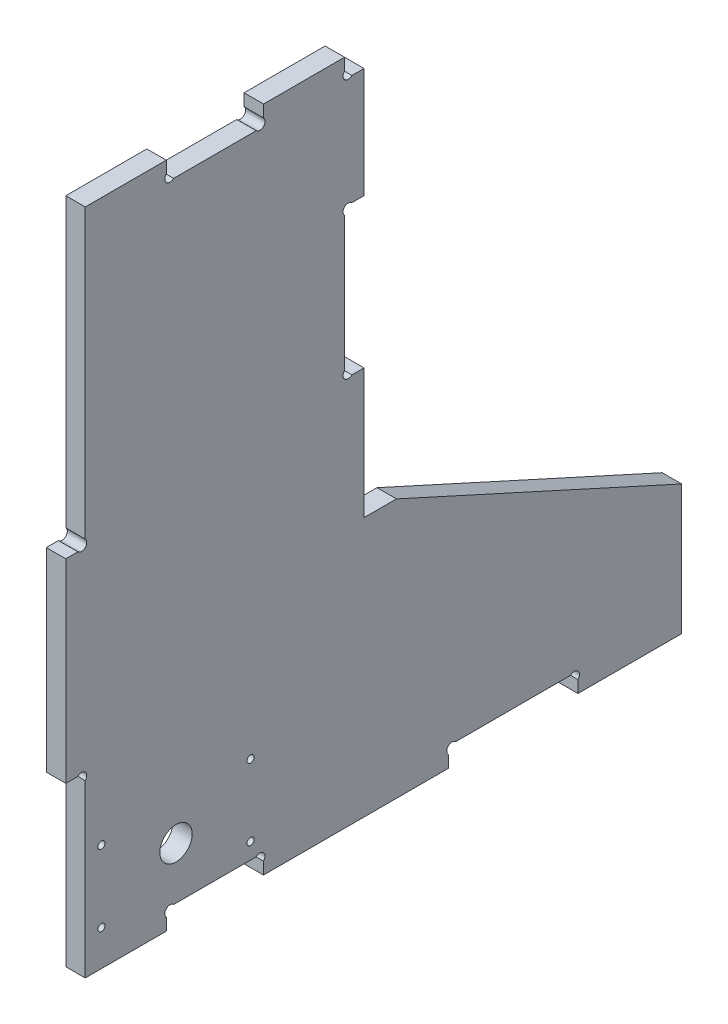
ISO-10303-21;
HEADER;
FILE_DESCRIPTION(('STEP AP214'),'2;1');
FILE_NAME('part.step','',(''),(''),'','','');
FILE_SCHEMA(('AUTOMOTIVE_DESIGN { 1 0 10303 214 1 1 1 1 }'));
ENDSEC;
DATA;
#1=APPLICATION_CONTEXT('core data for automotive mechanical design processes');
#2=APPLICATION_PROTOCOL_DEFINITION('international standard','automotive_design',2000,#1);
#3=PRODUCT_CONTEXT('',#1,'mechanical');
#4=PRODUCT('Part','Part','',(#3));
#5=PRODUCT_RELATED_PRODUCT_CATEGORY('part','',(#4));
#6=PRODUCT_DEFINITION_FORMATION('','',#4);
#7=PRODUCT_DEFINITION_CONTEXT('part definition',#1,'design');
#8=PRODUCT_DEFINITION('design','',#6,#7);
#9=PRODUCT_DEFINITION_SHAPE('','',#8);
#10=(LENGTH_UNIT() NAMED_UNIT(*) SI_UNIT(.MILLI.,.METRE.));
#11=(NAMED_UNIT(*) PLANE_ANGLE_UNIT() SI_UNIT($,.RADIAN.));
#12=(NAMED_UNIT(*) SI_UNIT($,.STERADIAN.) SOLID_ANGLE_UNIT());
#13=UNCERTAINTY_MEASURE_WITH_UNIT(LENGTH_MEASURE(1.E-05),#10,'distance_accuracy_value','');
#14=(GEOMETRIC_REPRESENTATION_CONTEXT(3) GLOBAL_UNCERTAINTY_ASSIGNED_CONTEXT((#13)) GLOBAL_UNIT_ASSIGNED_CONTEXT((#10,
#11,#12)) REPRESENTATION_CONTEXT('',''));
#15=CARTESIAN_POINT('',(0.,0.,0.));
#16=DIRECTION('',(0.,0.,1.));
#17=DIRECTION('',(1.,0.,0.));
#18=AXIS2_PLACEMENT_3D('',#15,#16,#17);
#19=CARTESIAN_POINT('',(6.,4.86862915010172,-156.868629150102));
#20=DIRECTION('',(1.,0.,0.));
#21=DIRECTION('',(0.,0.,-1.));
#22=AXIS2_PLACEMENT_3D('',#19,#20,#21);
#23=PLANE('',#22);
#24=CARTESIAN_POINT('',(6.,33.,-11.));
#25=DIRECTION('',(1.,0.,0.));
#26=DIRECTION('',(0.,0.,1.));
#27=AXIS2_PLACEMENT_3D('',#24,#25,#26);
#28=CIRCLE('',#27,1.1);
#29=CARTESIAN_POINT('',(6.,33.,-9.89999999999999));
#30=VERTEX_POINT('',#29);
#31=EDGE_CURVE('E659',#30,#30,#28,.T.);
#32=ORIENTED_EDGE('',*,*,#31,.F.);
#33=EDGE_LOOP('',(#32));
#34=FACE_BOUND('',#33,.T.);
#35=CARTESIAN_POINT('',(6.,11.,-57.));
#36=DIRECTION('',(1.,0.,0.));
#37=DIRECTION('',(0.,0.,1.));
#38=AXIS2_PLACEMENT_3D('',#35,#36,#37);
#39=CIRCLE('',#38,1.09999999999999);
#40=CARTESIAN_POINT('',(6.,11.,-55.9));
#41=VERTEX_POINT('',#40);
#42=EDGE_CURVE('E671',#41,#41,#39,.T.);
#43=ORIENTED_EDGE('',*,*,#42,.F.);
#44=EDGE_LOOP('',(#43));
#45=FACE_BOUND('',#44,.T.);
#46=DIRECTION('',(0.,1.,0.));
#47=VECTOR('',#46,1.);
#48=CARTESIAN_POINT('',(6.,120.,-92.));
#49=LINE('',#48,#47);
#50=CARTESIAN_POINT('',(6.,80.,-92.));
#51=VERTEX_POINT('',#50);
#52=CARTESIAN_POINT('',(6.,120.,-92.));
#53=VERTEX_POINT('',#52);
#54=EDGE_CURVE('E401',#51,#53,#49,.T.);
#55=ORIENTED_EDGE('',*,*,#54,.T.);
#56=DIRECTION('',(0.,0.,1.));
#57=VECTOR('',#56,1.);
#58=CARTESIAN_POINT('',(6.,120.,-88.2627416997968));
#59=LINE('',#58,#57);
#60=CARTESIAN_POINT('',(6.,120.,-88.2627416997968));
#61=VERTEX_POINT('',#60);
#62=EDGE_CURVE('E189',#53,#61,#59,.T.);
#63=ORIENTED_EDGE('',*,*,#62,.T.);
#64=CARTESIAN_POINT('',(6.,121.131370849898,-87.1313708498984));
#65=DIRECTION('',(-1.,0.,0.));
#66=DIRECTION('',(0.,0.,1.));
#67=AXIS2_PLACEMENT_3D('',#64,#65,#66);
#68=CIRCLE('',#67,1.59999999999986);
#69=CARTESIAN_POINT('',(6.,122.262741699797,-86.));
#70=VERTEX_POINT('',#69);
#71=EDGE_CURVE('E512',#61,#70,#68,.T.);
#72=ORIENTED_EDGE('',*,*,#71,.T.);
#73=DIRECTION('',(0.,1.,0.));
#74=VECTOR('',#73,1.);
#75=CARTESIAN_POINT('',(6.,163.737258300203,-86.));
#76=LINE('',#75,#74);
#77=CARTESIAN_POINT('',(6.,163.737258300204,-86.0000000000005));
#78=VERTEX_POINT('',#77);
#79=EDGE_CURVE('E531',#70,#78,#76,.T.);
#80=ORIENTED_EDGE('',*,*,#79,.T.);
#81=CARTESIAN_POINT('',(6.,164.868629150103,-87.1313708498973));
#82=DIRECTION('',(-1.,0.,0.));
#83=DIRECTION('',(0.,0.,-1.));
#84=AXIS2_PLACEMENT_3D('',#81,#82,#83);
#85=CIRCLE('',#84,1.59999999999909);
#86=CARTESIAN_POINT('',(6.,166.,-88.2627416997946));
#87=VERTEX_POINT('',#86);
#88=EDGE_CURVE('E528',#78,#87,#85,.T.);
#89=ORIENTED_EDGE('',*,*,#88,.T.);
#90=DIRECTION('',(0.,0.,-1.));
#91=VECTOR('',#90,1.);
#92=CARTESIAN_POINT('',(6.,166.,-88.2627416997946));
#93=LINE('',#92,#91);
#94=CARTESIAN_POINT('',(6.,166.,-92.));
#95=VERTEX_POINT('',#94);
#96=EDGE_CURVE('E530',#87,#95,#93,.T.);
#97=ORIENTED_EDGE('',*,*,#96,.T.);
#98=DIRECTION('',(0.,1.,0.));
#99=VECTOR('',#98,1.);
#100=CARTESIAN_POINT('',(6.,200.,-92.));
#101=LINE('',#100,#99);
#102=CARTESIAN_POINT('',(6.,200.,-92.));
#103=VERTEX_POINT('',#102);
#104=EDGE_CURVE('E533',#95,#103,#101,.T.);
#105=ORIENTED_EDGE('',*,*,#104,.T.);
#106=DIRECTION('',(0.,0.,1.));
#107=VECTOR('',#106,1.);
#108=CARTESIAN_POINT('',(6.,200.,-88.262741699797));
#109=LINE('',#108,#107);
#110=CARTESIAN_POINT('',(6.,200.,-88.262741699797));
#111=VERTEX_POINT('',#110);
#112=EDGE_CURVE('E539',#103,#111,#109,.T.);
#113=ORIENTED_EDGE('',*,*,#112,.T.);
#114=CARTESIAN_POINT('',(6.,201.131370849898,-87.1313708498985));
#115=DIRECTION('',(-1.,0.,0.));
#116=DIRECTION('',(0.,0.,-1.));
#117=AXIS2_PLACEMENT_3D('',#114,#115,#116);
#118=CIRCLE('',#117,1.60000000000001);
#119=CARTESIAN_POINT('',(6.,202.262741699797,-86.));
#120=VERTEX_POINT('',#119);
#121=EDGE_CURVE('E541',#111,#120,#118,.T.);
#122=ORIENTED_EDGE('',*,*,#121,.T.);
#123=DIRECTION('',(0.,1.,0.));
#124=VECTOR('',#123,1.);
#125=CARTESIAN_POINT('',(6.,206.,-86.));
#126=LINE('',#125,#124);
#127=CARTESIAN_POINT('',(6.,206.,-86.));
#128=VERTEX_POINT('',#127);
#129=EDGE_CURVE('E543',#120,#128,#126,.T.);
#130=ORIENTED_EDGE('',*,*,#129,.T.);
#131=DIRECTION('',(0.,0.,1.));
#132=VECTOR('',#131,1.);
#133=CARTESIAN_POINT('',(6.,206.,-61.));
#134=LINE('',#133,#132);
#135=CARTESIAN_POINT('',(6.,206.,-61.));
#136=VERTEX_POINT('',#135);
#137=EDGE_CURVE('E545',#128,#136,#134,.T.);
#138=ORIENTED_EDGE('',*,*,#137,.T.);
#139=DIRECTION('',(0.,-1.,0.));
#140=VECTOR('',#139,1.);
#141=CARTESIAN_POINT('',(6.,202.262741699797,-61.));
#142=LINE('',#141,#140);
#143=CARTESIAN_POINT('',(6.,202.262741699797,-61.));
#144=VERTEX_POINT('',#143);
#145=EDGE_CURVE('E547',#136,#144,#142,.T.);
#146=ORIENTED_EDGE('',*,*,#145,.T.);
#147=CARTESIAN_POINT('',(6.,201.131370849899,-59.8686291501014));
#148=DIRECTION('',(-1.,0.,0.));
#149=DIRECTION('',(0.,0.,-1.));
#150=AXIS2_PLACEMENT_3D('',#147,#148,#149);
#151=CIRCLE('',#150,1.60000000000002);
#152=CARTESIAN_POINT('',(6.,200.,-58.737258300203));
#153=VERTEX_POINT('',#152);
#154=EDGE_CURVE('E549',#144,#153,#151,.T.);
#155=ORIENTED_EDGE('',*,*,#154,.T.);
#156=DIRECTION('',(0.,0.,1.));
#157=VECTOR('',#156,1.);
#158=CARTESIAN_POINT('',(6.,200.,-33.262741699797));
#159=LINE('',#158,#157);
#160=CARTESIAN_POINT('',(6.,200.,-33.262741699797));
#161=VERTEX_POINT('',#160);
#162=EDGE_CURVE('E551',#153,#161,#159,.T.);
#163=ORIENTED_EDGE('',*,*,#162,.T.);
#164=CARTESIAN_POINT('',(6.,201.131370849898,-32.1313708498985));
#165=DIRECTION('',(-1.,0.,0.));
#166=DIRECTION('',(0.,0.,1.));
#167=AXIS2_PLACEMENT_3D('',#164,#165,#166);
#168=CIRCLE('',#167,1.60000000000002);
#169=CARTESIAN_POINT('',(6.,202.262741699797,-31.));
#170=VERTEX_POINT('',#169);
#171=EDGE_CURVE('E553',#161,#170,#168,.T.);
#172=ORIENTED_EDGE('',*,*,#171,.T.);
#173=DIRECTION('',(0.,1.,0.));
#174=VECTOR('',#173,1.);
#175=CARTESIAN_POINT('',(6.,202.262741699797,-31.));
#176=LINE('',#175,#174);
#177=CARTESIAN_POINT('',(6.,206.,-31.));
#178=VERTEX_POINT('',#177);
#179=EDGE_CURVE('E555',#170,#178,#176,.T.);
#180=ORIENTED_EDGE('',*,*,#179,.T.);
#181=DIRECTION('',(0.,0.,1.));
#182=VECTOR('',#181,1.);
#183=CARTESIAN_POINT('',(6.,206.,-6.));
#184=LINE('',#183,#182);
#185=CARTESIAN_POINT('',(6.,206.,-6.));
#186=VERTEX_POINT('',#185);
#187=EDGE_CURVE('E557',#178,#186,#184,.T.);
#188=ORIENTED_EDGE('',*,*,#187,.T.);
#189=DIRECTION('',(0.,-1.,0.));
#190=VECTOR('',#189,1.);
#191=CARTESIAN_POINT('',(6.,117.262741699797,-6.));
#192=LINE('',#191,#190);
#193=CARTESIAN_POINT('',(6.,117.262741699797,-6.00000000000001));
#194=VERTEX_POINT('',#193);
#195=EDGE_CURVE('E559',#186,#194,#192,.T.);
#196=ORIENTED_EDGE('',*,*,#195,.T.);
#197=CARTESIAN_POINT('',(6.,116.131370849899,-4.86862915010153));
#198=DIRECTION('',(-1.,0.,0.));
#199=DIRECTION('',(0.,0.,1.));
#200=AXIS2_PLACEMENT_3D('',#197,#198,#199);
#201=CIRCLE('',#200,1.60000000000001);
#202=CARTESIAN_POINT('',(6.,115.,-3.73725830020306));
#203=VERTEX_POINT('',#202);
#204=EDGE_CURVE('E561',#194,#203,#201,.T.);
#205=ORIENTED_EDGE('',*,*,#204,.T.);
#206=DIRECTION('',(0.,0.,1.));
#207=VECTOR('',#206,1.);
#208=CARTESIAN_POINT('',(6.,115.,-3.73725830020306));
#209=LINE('',#208,#207);
#210=CARTESIAN_POINT('',(6.,115.,0.));
#211=VERTEX_POINT('',#210);
#212=EDGE_CURVE('E563',#203,#211,#209,.T.);
#213=ORIENTED_EDGE('',*,*,#212,.T.);
#214=DIRECTION('',(0.,-1.,0.));
#215=VECTOR('',#214,1.);
#216=CARTESIAN_POINT('',(6.,115.,0.));
#217=LINE('',#216,#215);
#218=CARTESIAN_POINT('',(6.,55.,0.));
#219=VERTEX_POINT('',#218);
#220=EDGE_CURVE('E565',#211,#219,#217,.T.);
#221=ORIENTED_EDGE('',*,*,#220,.T.);
#222=DIRECTION('',(0.,0.,-1.));
#223=VECTOR('',#222,1.);
#224=CARTESIAN_POINT('',(6.,55.,0.));
#225=LINE('',#224,#223);
#226=CARTESIAN_POINT('',(6.,55.,-3.73725830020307));
#227=VERTEX_POINT('',#226);
#228=EDGE_CURVE('E567',#219,#227,#225,.T.);
#229=ORIENTED_EDGE('',*,*,#228,.T.);
#230=CARTESIAN_POINT('',(6.,53.8686291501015,-4.86862915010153));
#231=DIRECTION('',(-1.,0.,0.));
#232=DIRECTION('',(0.,0.,-1.));
#233=AXIS2_PLACEMENT_3D('',#230,#231,#232);
#234=CIRCLE('',#233,1.59999999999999);
#235=CARTESIAN_POINT('',(6.,52.7372583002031,-6.));
#236=VERTEX_POINT('',#235);
#237=EDGE_CURVE('E569',#227,#236,#234,.T.);
#238=ORIENTED_EDGE('',*,*,#237,.T.);
#239=DIRECTION('',(0.,-1.,0.));
#240=VECTOR('',#239,1.);
#241=CARTESIAN_POINT('',(6.,52.7372583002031,-6.));
#242=LINE('',#241,#240);
#243=CARTESIAN_POINT('',(6.,0.,-6.));
#244=VERTEX_POINT('',#243);
#245=EDGE_CURVE('E571',#236,#244,#242,.T.);
#246=ORIENTED_EDGE('',*,*,#245,.T.);
#247=DIRECTION('',(0.,0.,-1.));
#248=VECTOR('',#247,1.);
#249=CARTESIAN_POINT('',(6.,0.,-6.));
#250=LINE('',#249,#248);
#251=CARTESIAN_POINT('',(6.,0.,-31.));
#252=VERTEX_POINT('',#251);
#253=EDGE_CURVE('E573',#244,#252,#250,.T.);
#254=ORIENTED_EDGE('',*,*,#253,.T.);
#255=DIRECTION('',(0.,1.,0.));
#256=VECTOR('',#255,1.);
#257=CARTESIAN_POINT('',(6.,3.73725830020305,-31.));
#258=LINE('',#257,#256);
#259=CARTESIAN_POINT('',(6.,3.73725830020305,-31.));
#260=VERTEX_POINT('',#259);
#261=EDGE_CURVE('E575',#252,#260,#258,.T.);
#262=ORIENTED_EDGE('',*,*,#261,.T.);
#263=CARTESIAN_POINT('',(6.,4.86862915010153,-32.1313708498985));
#264=DIRECTION('',(-1.,0.,0.));
#265=DIRECTION('',(0.,0.,-1.));
#266=AXIS2_PLACEMENT_3D('',#263,#264,#265);
#267=CIRCLE('',#266,1.60000000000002);
#268=CARTESIAN_POINT('',(6.,6.00000000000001,-33.262741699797));
#269=VERTEX_POINT('',#268);
#270=EDGE_CURVE('E577',#260,#269,#267,.T.);
#271=ORIENTED_EDGE('',*,*,#270,.T.);
#272=DIRECTION('',(0.,0.,-1.));
#273=VECTOR('',#272,1.);
#274=CARTESIAN_POINT('',(6.,6.00000000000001,-33.262741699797));
#275=LINE('',#274,#273);
#276=CARTESIAN_POINT('',(6.,6.00000000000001,-58.737258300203));
#277=VERTEX_POINT('',#276);
#278=EDGE_CURVE('E579',#269,#277,#275,.T.);
#279=ORIENTED_EDGE('',*,*,#278,.T.);
#280=CARTESIAN_POINT('',(6.,4.86862915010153,-59.8686291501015));
#281=DIRECTION('',(-1.,0.,0.));
#282=DIRECTION('',(0.,0.,1.));
#283=AXIS2_PLACEMENT_3D('',#280,#281,#282);
#284=CIRCLE('',#283,1.60000000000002);
#285=CARTESIAN_POINT('',(6.,3.73725830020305,-61.));
#286=VERTEX_POINT('',#285);
#287=EDGE_CURVE('E581',#277,#286,#284,.T.);
#288=ORIENTED_EDGE('',*,*,#287,.T.);
#289=DIRECTION('',(0.,-1.,0.));
#290=VECTOR('',#289,1.);
#291=CARTESIAN_POINT('',(6.,3.73725830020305,-61.));
#292=LINE('',#291,#290);
#293=CARTESIAN_POINT('',(6.,0.,-61.));
#294=VERTEX_POINT('',#293);
#295=EDGE_CURVE('E583',#286,#294,#292,.T.);
#296=ORIENTED_EDGE('',*,*,#295,.T.);
#297=DIRECTION('',(0.,0.,-1.));
#298=VECTOR('',#297,1.);
#299=CARTESIAN_POINT('',(6.,0.,-61.));
#300=LINE('',#299,#298);
#301=CARTESIAN_POINT('',(6.,0.,-118.));
#302=VERTEX_POINT('',#301);
#303=EDGE_CURVE('E585',#294,#302,#300,.T.);
#304=ORIENTED_EDGE('',*,*,#303,.T.);
#305=DIRECTION('',(0.,1.,0.));
#306=VECTOR('',#305,1.);
#307=CARTESIAN_POINT('',(6.,3.7372583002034,-118.));
#308=LINE('',#307,#306);
#309=CARTESIAN_POINT('',(6.,3.7372583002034,-118.));
#310=VERTEX_POINT('',#309);
#311=EDGE_CURVE('E587',#302,#310,#308,.T.);
#312=ORIENTED_EDGE('',*,*,#311,.T.);
#313=CARTESIAN_POINT('',(6.,4.86862915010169,-119.131370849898));
#314=DIRECTION('',(-1.,0.,0.));
#315=DIRECTION('',(0.,0.,1.));
#316=AXIS2_PLACEMENT_3D('',#313,#314,#315);
#317=CIRCLE('',#316,1.59999999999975);
#318=CARTESIAN_POINT('',(6.,5.99999999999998,-120.262741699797));
#319=VERTEX_POINT('',#318);
#320=EDGE_CURVE('E589',#310,#319,#317,.T.);
#321=ORIENTED_EDGE('',*,*,#320,.T.);
#322=DIRECTION('',(0.,0.,-1.));
#323=VECTOR('',#322,1.);
#324=CARTESIAN_POINT('',(6.,5.99999999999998,-120.262741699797));
#325=LINE('',#324,#323);
#326=CARTESIAN_POINT('',(6.,5.99999999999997,-155.737258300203));
#327=VERTEX_POINT('',#326);
#328=EDGE_CURVE('E591',#319,#327,#325,.T.);
#329=ORIENTED_EDGE('',*,*,#328,.T.);
#330=CARTESIAN_POINT('',(6.,4.86862915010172,-156.868629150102));
#331=DIRECTION('',(-1.,0.,0.));
#332=DIRECTION('',(0.,0.,-1.));
#333=AXIS2_PLACEMENT_3D('',#330,#331,#332);
#334=CIRCLE('',#333,1.59999999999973);
#335=CARTESIAN_POINT('',(6.,3.73725830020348,-158.));
#336=VERTEX_POINT('',#335);
#337=EDGE_CURVE('E593',#327,#336,#334,.T.);
#338=ORIENTED_EDGE('',*,*,#337,.T.);
#339=DIRECTION('',(0.,-1.,0.));
#340=VECTOR('',#339,1.);
#341=CARTESIAN_POINT('',(6.,3.73725830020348,-158.));
#342=LINE('',#341,#340);
#343=CARTESIAN_POINT('',(6.,0.,-158.));
#344=VERTEX_POINT('',#343);
#345=EDGE_CURVE('E595',#336,#344,#342,.T.);
#346=ORIENTED_EDGE('',*,*,#345,.T.);
#347=DIRECTION('',(0.,0.,-1.));
#348=VECTOR('',#347,1.);
#349=CARTESIAN_POINT('',(6.,0.,-190.));
#350=LINE('',#349,#348);
#351=CARTESIAN_POINT('',(6.,0.,-190.));
#352=VERTEX_POINT('',#351);
#353=EDGE_CURVE('E304',#344,#352,#350,.T.);
#354=ORIENTED_EDGE('',*,*,#353,.T.);
#355=DIRECTION('',(0.,1.,0.));
#356=VECTOR('',#355,1.);
#357=CARTESIAN_POINT('',(6.,40.,-190.));
#358=LINE('',#357,#356);
#359=CARTESIAN_POINT('',(6.,40.,-190.));
#360=VERTEX_POINT('',#359);
#361=EDGE_CURVE('E298',#352,#360,#358,.T.);
#362=ORIENTED_EDGE('',*,*,#361,.T.);
#363=DIRECTION('',(0.,0.413802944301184,0.910366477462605));
#364=VECTOR('',#363,1.);
#365=CARTESIAN_POINT('',(6.,40.,-190.));
#366=LINE('',#365,#364);
#367=CARTESIAN_POINT('',(6.,80.,-102.));
#368=VERTEX_POINT('',#367);
#369=EDGE_CURVE('E302',#360,#368,#366,.T.);
#370=ORIENTED_EDGE('',*,*,#369,.T.);
#371=DIRECTION('',(0.,0.,1.));
#372=VECTOR('',#371,1.);
#373=CARTESIAN_POINT('',(6.,80.,-92.));
#374=LINE('',#373,#372);
#375=EDGE_CURVE('E50',#368,#51,#374,.T.);
#376=ORIENTED_EDGE('',*,*,#375,.T.);
#377=EDGE_LOOP('',(#55,#63,#72,#80,#89,#97,#105,#113,#122,#130,#138,#146,#155,#163,#172,#180,
#188,#196,#205,#213,#221,#229,#238,#246,#254,#262,#271,#279,#288,#296,#304,#312,#321,#329,#338,
#346,#354,#362,#370,#376));
#378=FACE_BOUND('',#377,.T.);
#379=CARTESIAN_POINT('',(6.,11.,-11.));
#380=DIRECTION('',(1.,0.,0.));
#381=DIRECTION('',(0.,0.,-1.));
#382=AXIS2_PLACEMENT_3D('',#379,#380,#381);
#383=CIRCLE('',#382,1.1);
#384=CARTESIAN_POINT('',(6.,11.,-12.1));
#385=VERTEX_POINT('',#384);
#386=EDGE_CURVE('E326',#385,#385,#383,.T.);
#387=ORIENTED_EDGE('',*,*,#386,.F.);
#388=EDGE_LOOP('',(#387));
#389=FACE_BOUND('',#388,.T.);
#390=CARTESIAN_POINT('',(6.,33.,-57.));
#391=DIRECTION('',(1.,0.,0.));
#392=DIRECTION('',(0.,0.,-1.));
#393=AXIS2_PLACEMENT_3D('',#390,#391,#392);
#394=CIRCLE('',#393,1.1);
#395=CARTESIAN_POINT('',(6.,33.,-58.1));
#396=VERTEX_POINT('',#395);
#397=EDGE_CURVE('E665',#396,#396,#394,.T.);
#398=ORIENTED_EDGE('',*,*,#397,.F.);
#399=EDGE_LOOP('',(#398));
#400=FACE_BOUND('',#399,.T.);
#401=CARTESIAN_POINT('',(6.,22.,-34.));
#402=DIRECTION('',(1.,0.,0.));
#403=DIRECTION('',(0.,0.,-1.));
#404=AXIS2_PLACEMENT_3D('',#401,#402,#403);
#405=CIRCLE('',#404,5.);
#406=CARTESIAN_POINT('',(6.,22.,-39.));
#407=VERTEX_POINT('',#406);
#408=EDGE_CURVE('E650',#407,#407,#405,.T.);
#409=ORIENTED_EDGE('',*,*,#408,.F.);
#410=EDGE_LOOP('',(#409));
#411=FACE_BOUND('',#410,.T.);
#412=ADVANCED_FACE('F33',(#34,#45,#378,#389,#400,#411),#23,.T.);
#413=CARTESIAN_POINT('',(0.,4.86862915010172,-156.868629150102));
#414=DIRECTION('',(1.,0.,0.));
#415=DIRECTION('',(0.,0.,-1.));
#416=AXIS2_PLACEMENT_3D('',#413,#414,#415);
#417=PLANE('',#416);
#418=DIRECTION('',(0.,1.,0.));
#419=VECTOR('',#418,1.);
#420=CARTESIAN_POINT('',(0.,120.,-92.));
#421=LINE('',#420,#419);
#422=CARTESIAN_POINT('',(0.,80.,-92.));
#423=VERTEX_POINT('',#422);
#424=CARTESIAN_POINT('',(0.,120.,-92.));
#425=VERTEX_POINT('',#424);
#426=EDGE_CURVE('E322',#423,#425,#421,.T.);
#427=ORIENTED_EDGE('',*,*,#426,.F.);
#428=DIRECTION('',(0.,0.,1.));
#429=VECTOR('',#428,1.);
#430=CARTESIAN_POINT('',(0.,80.,-92.));
#431=LINE('',#430,#429);
#432=CARTESIAN_POINT('',(0.,80.,-102.));
#433=VERTEX_POINT('',#432);
#434=EDGE_CURVE('E181',#433,#423,#431,.T.);
#435=ORIENTED_EDGE('',*,*,#434,.F.);
#436=DIRECTION('',(0.,0.413802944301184,0.910366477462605));
#437=VECTOR('',#436,1.);
#438=CARTESIAN_POINT('',(0.,40.,-190.));
#439=LINE('',#438,#437);
#440=CARTESIAN_POINT('',(0.,40.,-190.));
#441=VERTEX_POINT('',#440);
#442=EDGE_CURVE('E175',#441,#433,#439,.T.);
#443=ORIENTED_EDGE('',*,*,#442,.F.);
#444=DIRECTION('',(0.,1.,0.));
#445=VECTOR('',#444,1.);
#446=CARTESIAN_POINT('',(0.,40.,-190.));
#447=LINE('',#446,#445);
#448=CARTESIAN_POINT('',(0.,0.,-190.));
#449=VERTEX_POINT('',#448);
#450=EDGE_CURVE('E312',#449,#441,#447,.T.);
#451=ORIENTED_EDGE('',*,*,#450,.F.);
#452=DIRECTION('',(0.,0.,-1.));
#453=VECTOR('',#452,1.);
#454=CARTESIAN_POINT('',(0.,0.,-190.));
#455=LINE('',#454,#453);
#456=CARTESIAN_POINT('',(0.,0.,-158.));
#457=VERTEX_POINT('',#456);
#458=EDGE_CURVE('E396',#457,#449,#455,.T.);
#459=ORIENTED_EDGE('',*,*,#458,.F.);
#460=DIRECTION('',(0.,-1.,0.));
#461=VECTOR('',#460,1.);
#462=CARTESIAN_POINT('',(0.,3.73725830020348,-158.));
#463=LINE('',#462,#461);
#464=CARTESIAN_POINT('',(0.,3.73725830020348,-158.));
#465=VERTEX_POINT('',#464);
#466=EDGE_CURVE('E394',#465,#457,#463,.T.);
#467=ORIENTED_EDGE('',*,*,#466,.F.);
#468=CARTESIAN_POINT('',(0.,4.86862915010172,-156.868629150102));
#469=DIRECTION('',(-1.,0.,0.));
#470=DIRECTION('',(0.,0.,-1.));
#471=AXIS2_PLACEMENT_3D('',#468,#469,#470);
#472=CIRCLE('',#471,1.59999999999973);
#473=CARTESIAN_POINT('',(0.,5.99999999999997,-155.737258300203));
#474=VERTEX_POINT('',#473);
#475=EDGE_CURVE('E392',#474,#465,#472,.T.);
#476=ORIENTED_EDGE('',*,*,#475,.F.);
#477=DIRECTION('',(0.,0.,-1.));
#478=VECTOR('',#477,1.);
#479=CARTESIAN_POINT('',(0.,5.99999999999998,-120.262741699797));
#480=LINE('',#479,#478);
#481=CARTESIAN_POINT('',(0.,5.99999999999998,-120.262741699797));
#482=VERTEX_POINT('',#481);
#483=EDGE_CURVE('E390',#482,#474,#480,.T.);
#484=ORIENTED_EDGE('',*,*,#483,.F.);
#485=CARTESIAN_POINT('',(0.,4.86862915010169,-119.131370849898));
#486=DIRECTION('',(-1.,0.,0.));
#487=DIRECTION('',(0.,0.,1.));
#488=AXIS2_PLACEMENT_3D('',#485,#486,#487);
#489=CIRCLE('',#488,1.59999999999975);
#490=CARTESIAN_POINT('',(0.,3.7372583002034,-118.));
#491=VERTEX_POINT('',#490);
#492=EDGE_CURVE('E388',#491,#482,#489,.T.);
#493=ORIENTED_EDGE('',*,*,#492,.F.);
#494=DIRECTION('',(0.,1.,0.));
#495=VECTOR('',#494,1.);
#496=CARTESIAN_POINT('',(0.,3.7372583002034,-118.));
#497=LINE('',#496,#495);
#498=CARTESIAN_POINT('',(0.,0.,-118.));
#499=VERTEX_POINT('',#498);
#500=EDGE_CURVE('E386',#499,#491,#497,.T.);
#501=ORIENTED_EDGE('',*,*,#500,.F.);
#502=DIRECTION('',(0.,0.,-1.));
#503=VECTOR('',#502,1.);
#504=CARTESIAN_POINT('',(0.,0.,-61.));
#505=LINE('',#504,#503);
#506=CARTESIAN_POINT('',(0.,0.,-61.));
#507=VERTEX_POINT('',#506);
#508=EDGE_CURVE('E384',#507,#499,#505,.T.);
#509=ORIENTED_EDGE('',*,*,#508,.F.);
#510=DIRECTION('',(0.,-1.,0.));
#511=VECTOR('',#510,1.);
#512=CARTESIAN_POINT('',(0.,3.73725830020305,-61.));
#513=LINE('',#512,#511);
#514=CARTESIAN_POINT('',(0.,3.73725830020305,-61.));
#515=VERTEX_POINT('',#514);
#516=EDGE_CURVE('E382',#515,#507,#513,.T.);
#517=ORIENTED_EDGE('',*,*,#516,.F.);
#518=CARTESIAN_POINT('',(0.,4.86862915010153,-59.8686291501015));
#519=DIRECTION('',(-1.,0.,0.));
#520=DIRECTION('',(0.,0.,1.));
#521=AXIS2_PLACEMENT_3D('',#518,#519,#520);
#522=CIRCLE('',#521,1.60000000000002);
#523=CARTESIAN_POINT('',(0.,6.00000000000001,-58.737258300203));
#524=VERTEX_POINT('',#523);
#525=EDGE_CURVE('E380',#524,#515,#522,.T.);
#526=ORIENTED_EDGE('',*,*,#525,.F.);
#527=DIRECTION('',(0.,0.,-1.));
#528=VECTOR('',#527,1.);
#529=CARTESIAN_POINT('',(0.,6.00000000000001,-33.262741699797));
#530=LINE('',#529,#528);
#531=CARTESIAN_POINT('',(0.,6.00000000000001,-33.262741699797));
#532=VERTEX_POINT('',#531);
#533=EDGE_CURVE('E378',#532,#524,#530,.T.);
#534=ORIENTED_EDGE('',*,*,#533,.F.);
#535=CARTESIAN_POINT('',(0.,4.86862915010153,-32.1313708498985));
#536=DIRECTION('',(-1.,0.,0.));
#537=DIRECTION('',(0.,0.,-1.));
#538=AXIS2_PLACEMENT_3D('',#535,#536,#537);
#539=CIRCLE('',#538,1.60000000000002);
#540=CARTESIAN_POINT('',(0.,3.73725830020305,-31.));
#541=VERTEX_POINT('',#540);
#542=EDGE_CURVE('E376',#541,#532,#539,.T.);
#543=ORIENTED_EDGE('',*,*,#542,.F.);
#544=DIRECTION('',(0.,1.,0.));
#545=VECTOR('',#544,1.);
#546=CARTESIAN_POINT('',(0.,3.73725830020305,-31.));
#547=LINE('',#546,#545);
#548=CARTESIAN_POINT('',(0.,0.,-31.));
#549=VERTEX_POINT('',#548);
#550=EDGE_CURVE('E374',#549,#541,#547,.T.);
#551=ORIENTED_EDGE('',*,*,#550,.F.);
#552=DIRECTION('',(0.,0.,-1.));
#553=VECTOR('',#552,1.);
#554=CARTESIAN_POINT('',(0.,0.,-6.));
#555=LINE('',#554,#553);
#556=CARTESIAN_POINT('',(0.,0.,-6.));
#557=VERTEX_POINT('',#556);
#558=EDGE_CURVE('E372',#557,#549,#555,.T.);
#559=ORIENTED_EDGE('',*,*,#558,.F.);
#560=DIRECTION('',(0.,-1.,0.));
#561=VECTOR('',#560,1.);
#562=CARTESIAN_POINT('',(0.,52.7372583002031,-6.));
#563=LINE('',#562,#561);
#564=CARTESIAN_POINT('',(0.,52.7372583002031,-6.));
#565=VERTEX_POINT('',#564);
#566=EDGE_CURVE('E370',#565,#557,#563,.T.);
#567=ORIENTED_EDGE('',*,*,#566,.F.);
#568=CARTESIAN_POINT('',(0.,53.8686291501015,-4.86862915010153));
#569=DIRECTION('',(-1.,0.,0.));
#570=DIRECTION('',(0.,0.,-1.));
#571=AXIS2_PLACEMENT_3D('',#568,#569,#570);
#572=CIRCLE('',#571,1.59999999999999);
#573=CARTESIAN_POINT('',(0.,55.,-3.73725830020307));
#574=VERTEX_POINT('',#573);
#575=EDGE_CURVE('E368',#574,#565,#572,.T.);
#576=ORIENTED_EDGE('',*,*,#575,.F.);
#577=DIRECTION('',(0.,0.,-1.));
#578=VECTOR('',#577,1.);
#579=CARTESIAN_POINT('',(0.,55.,0.));
#580=LINE('',#579,#578);
#581=CARTESIAN_POINT('',(0.,55.,0.));
#582=VERTEX_POINT('',#581);
#583=EDGE_CURVE('E366',#582,#574,#580,.T.);
#584=ORIENTED_EDGE('',*,*,#583,.F.);
#585=DIRECTION('',(0.,-1.,0.));
#586=VECTOR('',#585,1.);
#587=CARTESIAN_POINT('',(0.,115.,0.));
#588=LINE('',#587,#586);
#589=CARTESIAN_POINT('',(0.,115.,0.));
#590=VERTEX_POINT('',#589);
#591=EDGE_CURVE('E364',#590,#582,#588,.T.);
#592=ORIENTED_EDGE('',*,*,#591,.F.);
#593=DIRECTION('',(0.,0.,1.));
#594=VECTOR('',#593,1.);
#595=CARTESIAN_POINT('',(0.,115.,-3.73725830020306));
#596=LINE('',#595,#594);
#597=CARTESIAN_POINT('',(0.,115.,-3.73725830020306));
#598=VERTEX_POINT('',#597);
#599=EDGE_CURVE('E362',#598,#590,#596,.T.);
#600=ORIENTED_EDGE('',*,*,#599,.F.);
#601=CARTESIAN_POINT('',(0.,116.131370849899,-4.86862915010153));
#602=DIRECTION('',(-1.,0.,0.));
#603=DIRECTION('',(0.,0.,1.));
#604=AXIS2_PLACEMENT_3D('',#601,#602,#603);
#605=CIRCLE('',#604,1.60000000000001);
#606=CARTESIAN_POINT('',(0.,117.262741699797,-6.00000000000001));
#607=VERTEX_POINT('',#606);
#608=EDGE_CURVE('E360',#607,#598,#605,.T.);
#609=ORIENTED_EDGE('',*,*,#608,.F.);
#610=DIRECTION('',(0.,-1.,0.));
#611=VECTOR('',#610,1.);
#612=CARTESIAN_POINT('',(0.,117.262741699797,-6.));
#613=LINE('',#612,#611);
#614=CARTESIAN_POINT('',(0.,206.,-6.));
#615=VERTEX_POINT('',#614);
#616=EDGE_CURVE('E358',#615,#607,#613,.T.);
#617=ORIENTED_EDGE('',*,*,#616,.F.);
#618=DIRECTION('',(0.,0.,1.));
#619=VECTOR('',#618,1.);
#620=CARTESIAN_POINT('',(0.,206.,-6.));
#621=LINE('',#620,#619);
#622=CARTESIAN_POINT('',(0.,206.,-31.));
#623=VERTEX_POINT('',#622);
#624=EDGE_CURVE('E356',#623,#615,#621,.T.);
#625=ORIENTED_EDGE('',*,*,#624,.F.);
#626=DIRECTION('',(0.,1.,0.));
#627=VECTOR('',#626,1.);
#628=CARTESIAN_POINT('',(0.,202.262741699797,-31.));
#629=LINE('',#628,#627);
#630=CARTESIAN_POINT('',(0.,202.262741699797,-31.));
#631=VERTEX_POINT('',#630);
#632=EDGE_CURVE('E354',#631,#623,#629,.T.);
#633=ORIENTED_EDGE('',*,*,#632,.F.);
#634=CARTESIAN_POINT('',(0.,201.131370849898,-32.1313708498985));
#635=DIRECTION('',(-1.,0.,0.));
#636=DIRECTION('',(0.,0.,1.));
#637=AXIS2_PLACEMENT_3D('',#634,#635,#636);
#638=CIRCLE('',#637,1.60000000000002);
#639=CARTESIAN_POINT('',(0.,200.,-33.262741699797));
#640=VERTEX_POINT('',#639);
#641=EDGE_CURVE('E352',#640,#631,#638,.T.);
#642=ORIENTED_EDGE('',*,*,#641,.F.);
#643=DIRECTION('',(0.,0.,1.));
#644=VECTOR('',#643,1.);
#645=CARTESIAN_POINT('',(0.,200.,-33.262741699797));
#646=LINE('',#645,#644);
#647=CARTESIAN_POINT('',(0.,200.,-58.737258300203));
#648=VERTEX_POINT('',#647);
#649=EDGE_CURVE('E350',#648,#640,#646,.T.);
#650=ORIENTED_EDGE('',*,*,#649,.F.);
#651=CARTESIAN_POINT('',(0.,201.131370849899,-59.8686291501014));
#652=DIRECTION('',(-1.,0.,0.));
#653=DIRECTION('',(0.,0.,-1.));
#654=AXIS2_PLACEMENT_3D('',#651,#652,#653);
#655=CIRCLE('',#654,1.60000000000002);
#656=CARTESIAN_POINT('',(0.,202.262741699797,-61.));
#657=VERTEX_POINT('',#656);
#658=EDGE_CURVE('E348',#657,#648,#655,.T.);
#659=ORIENTED_EDGE('',*,*,#658,.F.);
#660=DIRECTION('',(0.,-1.,0.));
#661=VECTOR('',#660,1.);
#662=CARTESIAN_POINT('',(0.,202.262741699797,-61.));
#663=LINE('',#662,#661);
#664=CARTESIAN_POINT('',(0.,206.,-61.));
#665=VERTEX_POINT('',#664);
#666=EDGE_CURVE('E346',#665,#657,#663,.T.);
#667=ORIENTED_EDGE('',*,*,#666,.F.);
#668=DIRECTION('',(0.,0.,1.));
#669=VECTOR('',#668,1.);
#670=CARTESIAN_POINT('',(0.,206.,-61.));
#671=LINE('',#670,#669);
#672=CARTESIAN_POINT('',(0.,206.,-86.));
#673=VERTEX_POINT('',#672);
#674=EDGE_CURVE('E344',#673,#665,#671,.T.);
#675=ORIENTED_EDGE('',*,*,#674,.F.);
#676=DIRECTION('',(0.,1.,0.));
#677=VECTOR('',#676,1.);
#678=CARTESIAN_POINT('',(0.,206.,-86.));
#679=LINE('',#678,#677);
#680=CARTESIAN_POINT('',(0.,202.262741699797,-86.));
#681=VERTEX_POINT('',#680);
#682=EDGE_CURVE('E342',#681,#673,#679,.T.);
#683=ORIENTED_EDGE('',*,*,#682,.F.);
#684=CARTESIAN_POINT('',(0.,201.131370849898,-87.1313708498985));
#685=DIRECTION('',(-1.,0.,0.));
#686=DIRECTION('',(0.,0.,-1.));
#687=AXIS2_PLACEMENT_3D('',#684,#685,#686);
#688=CIRCLE('',#687,1.60000000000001);
#689=CARTESIAN_POINT('',(0.,200.,-88.262741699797));
#690=VERTEX_POINT('',#689);
#691=EDGE_CURVE('E340',#690,#681,#688,.T.);
#692=ORIENTED_EDGE('',*,*,#691,.F.);
#693=DIRECTION('',(0.,0.,1.));
#694=VECTOR('',#693,1.);
#695=CARTESIAN_POINT('',(0.,200.,-88.262741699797));
#696=LINE('',#695,#694);
#697=CARTESIAN_POINT('',(0.,200.,-92.));
#698=VERTEX_POINT('',#697);
#699=EDGE_CURVE('E338',#698,#690,#696,.T.);
#700=ORIENTED_EDGE('',*,*,#699,.F.);
#701=DIRECTION('',(0.,1.,0.));
#702=VECTOR('',#701,1.);
#703=CARTESIAN_POINT('',(0.,200.,-92.));
#704=LINE('',#703,#702);
#705=CARTESIAN_POINT('',(0.,166.,-92.));
#706=VERTEX_POINT('',#705);
#707=EDGE_CURVE('E336',#706,#698,#704,.T.);
#708=ORIENTED_EDGE('',*,*,#707,.F.);
#709=DIRECTION('',(0.,0.,-1.));
#710=VECTOR('',#709,1.);
#711=CARTESIAN_POINT('',(0.,166.,-88.2627416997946));
#712=LINE('',#711,#710);
#713=CARTESIAN_POINT('',(0.,166.,-88.2627416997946));
#714=VERTEX_POINT('',#713);
#715=EDGE_CURVE('E334',#714,#706,#712,.T.);
#716=ORIENTED_EDGE('',*,*,#715,.F.);
#717=CARTESIAN_POINT('',(0.,164.868629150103,-87.1313708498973));
#718=DIRECTION('',(-1.,0.,0.));
#719=DIRECTION('',(0.,0.,-1.));
#720=AXIS2_PLACEMENT_3D('',#717,#718,#719);
#721=CIRCLE('',#720,1.59999999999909);
#722=CARTESIAN_POINT('',(0.,163.737258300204,-86.0000000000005));
#723=VERTEX_POINT('',#722);
#724=EDGE_CURVE('E332',#723,#714,#721,.T.);
#725=ORIENTED_EDGE('',*,*,#724,.F.);
#726=DIRECTION('',(0.,1.,0.));
#727=VECTOR('',#726,1.);
#728=CARTESIAN_POINT('',(0.,163.737258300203,-86.));
#729=LINE('',#728,#727);
#730=CARTESIAN_POINT('',(0.,122.262741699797,-86.));
#731=VERTEX_POINT('',#730);
#732=EDGE_CURVE('E330',#731,#723,#729,.T.);
#733=ORIENTED_EDGE('',*,*,#732,.F.);
#734=CARTESIAN_POINT('',(0.,121.131370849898,-87.1313708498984));
#735=DIRECTION('',(-1.,0.,0.));
#736=DIRECTION('',(0.,0.,1.));
#737=AXIS2_PLACEMENT_3D('',#734,#735,#736);
#738=CIRCLE('',#737,1.59999999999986);
#739=CARTESIAN_POINT('',(0.,120.,-88.2627416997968));
#740=VERTEX_POINT('',#739);
#741=EDGE_CURVE('E328',#740,#731,#738,.T.);
#742=ORIENTED_EDGE('',*,*,#741,.F.);
#743=DIRECTION('',(0.,0.,1.));
#744=VECTOR('',#743,1.);
#745=CARTESIAN_POINT('',(0.,120.,-88.2627416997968));
#746=LINE('',#745,#744);
#747=EDGE_CURVE('E325',#425,#740,#746,.T.);
#748=ORIENTED_EDGE('',*,*,#747,.F.);
#749=EDGE_LOOP('',(#427,#435,#443,#451,#459,#467,#476,#484,#493,#501,#509,#517,#526,#534,#543,
#551,#559,#567,#576,#584,#592,#600,#609,#617,#625,#633,#642,#650,#659,#667,#675,#683,#692,#700,
#708,#716,#725,#733,#742,#748));
#750=FACE_BOUND('',#749,.T.);
#751=CARTESIAN_POINT('',(0.,11.,-11.));
#752=DIRECTION('',(1.,0.,0.));
#753=DIRECTION('',(0.,0.,-1.));
#754=AXIS2_PLACEMENT_3D('',#751,#752,#753);
#755=CIRCLE('',#754,1.1);
#756=CARTESIAN_POINT('',(0.,11.,-12.1));
#757=VERTEX_POINT('',#756);
#758=EDGE_CURVE('E674',#757,#757,#755,.T.);
#759=ORIENTED_EDGE('',*,*,#758,.T.);
#760=EDGE_LOOP('',(#759));
#761=FACE_BOUND('',#760,.T.);
#762=CARTESIAN_POINT('',(0.,11.,-57.));
#763=DIRECTION('',(1.,0.,0.));
#764=DIRECTION('',(0.,0.,1.));
#765=AXIS2_PLACEMENT_3D('',#762,#763,#764);
#766=CIRCLE('',#765,1.09999999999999);
#767=CARTESIAN_POINT('',(0.,11.,-55.9));
#768=VERTEX_POINT('',#767);
#769=EDGE_CURVE('E668',#768,#768,#766,.T.);
#770=ORIENTED_EDGE('',*,*,#769,.T.);
#771=EDGE_LOOP('',(#770));
#772=FACE_BOUND('',#771,.T.);
#773=CARTESIAN_POINT('',(0.,33.,-57.));
#774=DIRECTION('',(1.,0.,0.));
#775=DIRECTION('',(0.,0.,-1.));
#776=AXIS2_PLACEMENT_3D('',#773,#774,#775);
#777=CIRCLE('',#776,1.1);
#778=CARTESIAN_POINT('',(0.,33.,-58.1));
#779=VERTEX_POINT('',#778);
#780=EDGE_CURVE('E662',#779,#779,#777,.T.);
#781=ORIENTED_EDGE('',*,*,#780,.T.);
#782=EDGE_LOOP('',(#781));
#783=FACE_BOUND('',#782,.T.);
#784=CARTESIAN_POINT('',(0.,33.,-11.));
#785=DIRECTION('',(1.,0.,0.));
#786=DIRECTION('',(0.,0.,1.));
#787=AXIS2_PLACEMENT_3D('',#784,#785,#786);
#788=CIRCLE('',#787,1.1);
#789=CARTESIAN_POINT('',(0.,33.,-9.89999999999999));
#790=VERTEX_POINT('',#789);
#791=EDGE_CURVE('E656',#790,#790,#788,.T.);
#792=ORIENTED_EDGE('',*,*,#791,.T.);
#793=EDGE_LOOP('',(#792));
#794=FACE_BOUND('',#793,.T.);
#795=CARTESIAN_POINT('',(0.,22.,-34.));
#796=DIRECTION('',(1.,0.,0.));
#797=DIRECTION('',(0.,0.,-1.));
#798=AXIS2_PLACEMENT_3D('',#795,#796,#797);
#799=CIRCLE('',#798,5.);
#800=CARTESIAN_POINT('',(0.,22.,-39.));
#801=VERTEX_POINT('',#800);
#802=EDGE_CURVE('E653',#801,#801,#799,.T.);
#803=ORIENTED_EDGE('',*,*,#802,.T.);
#804=EDGE_LOOP('',(#803));
#805=FACE_BOUND('',#804,.T.);
#806=ADVANCED_FACE('F516',(#750,#761,#772,#783,#794,#805),#417,.F.);
#807=CARTESIAN_POINT('',(6.,120.,-92.));
#808=DIRECTION('',(0.,0.,1.));
#809=DIRECTION('',(0.,-1.,0.));
#810=AXIS2_PLACEMENT_3D('',#807,#808,#809);
#811=PLANE('',#810);
#812=ORIENTED_EDGE('',*,*,#426,.T.);
#813=DIRECTION('',(-1.,0.,0.));
#814=VECTOR('',#813,1.);
#815=CARTESIAN_POINT('',(6.,120.,-92.));
#816=LINE('',#815,#814);
#817=EDGE_CURVE('E11',#53,#425,#816,.T.);
#818=ORIENTED_EDGE('',*,*,#817,.F.);
#819=ORIENTED_EDGE('',*,*,#54,.F.);
#820=DIRECTION('',(-1.,0.,0.));
#821=VECTOR('',#820,1.);
#822=CARTESIAN_POINT('',(6.,80.,-92.));
#823=LINE('',#822,#821);
#824=EDGE_CURVE('E318',#51,#423,#823,.T.);
#825=ORIENTED_EDGE('',*,*,#824,.T.);
#826=EDGE_LOOP('',(#812,#818,#819,#825));
#827=FACE_BOUND('',#826,.T.);
#828=ADVANCED_FACE('F35',(#827),#811,.F.);
#829=CARTESIAN_POINT('',(6.,120.,-88.2627416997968));
#830=DIRECTION('',(0.,-1.,0.));
#831=DIRECTION('',(0.,0.,-1.));
#832=AXIS2_PLACEMENT_3D('',#829,#830,#831);
#833=PLANE('',#832);
#834=ORIENTED_EDGE('',*,*,#747,.T.);
#835=DIRECTION('',(-1.,0.,0.));
#836=VECTOR('',#835,1.);
#837=CARTESIAN_POINT('',(6.,120.,-88.2627416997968));
#838=LINE('',#837,#836);
#839=EDGE_CURVE('E42',#61,#740,#838,.T.);
#840=ORIENTED_EDGE('',*,*,#839,.F.);
#841=ORIENTED_EDGE('',*,*,#62,.F.);
#842=ORIENTED_EDGE('',*,*,#817,.T.);
#843=EDGE_LOOP('',(#834,#840,#841,#842));
#844=FACE_BOUND('',#843,.T.);
#845=ADVANCED_FACE('F1073',(#844),#833,.F.);
#846=CARTESIAN_POINT('',(6.,121.131370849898,-87.1313708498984));
#847=DIRECTION('',(-1.,0.,0.));
#848=DIRECTION('',(0.,0.,1.));
#849=AXIS2_PLACEMENT_3D('',#846,#847,#848);
#850=CYLINDRICAL_SURFACE('',#849,1.59999999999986);
#851=ORIENTED_EDGE('',*,*,#741,.T.);
#852=DIRECTION('',(-1.,0.,0.));
#853=VECTOR('',#852,1.);
#854=CARTESIAN_POINT('',(6.,122.262741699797,-86.));
#855=LINE('',#854,#853);
#856=EDGE_CURVE('E504',#70,#731,#855,.T.);
#857=ORIENTED_EDGE('',*,*,#856,.F.);
#858=ORIENTED_EDGE('',*,*,#71,.F.);
#859=ORIENTED_EDGE('',*,*,#839,.T.);
#860=EDGE_LOOP('',(#851,#857,#858,#859));
#861=FACE_BOUND('',#860,.T.);
#862=ADVANCED_FACE('F510',(#861),#850,.F.);
#863=CARTESIAN_POINT('',(6.,163.737258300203,-86.));
#864=DIRECTION('',(0.,0.,1.));
#865=DIRECTION('',(1.,0.,0.));
#866=AXIS2_PLACEMENT_3D('',#863,#864,#865);
#867=PLANE('',#866);
#868=ORIENTED_EDGE('',*,*,#732,.T.);
#869=DIRECTION('',(-1.,0.,0.));
#870=VECTOR('',#869,1.);
#871=CARTESIAN_POINT('',(6.,163.737258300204,-86.0000000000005));
#872=LINE('',#871,#870);
#873=EDGE_CURVE('E501',#78,#723,#872,.T.);
#874=ORIENTED_EDGE('',*,*,#873,.F.);
#875=ORIENTED_EDGE('',*,*,#79,.F.);
#876=ORIENTED_EDGE('',*,*,#856,.T.);
#877=EDGE_LOOP('',(#868,#874,#875,#876));
#878=FACE_BOUND('',#877,.T.);
#879=ADVANCED_FACE('F522',(#878),#867,.F.);
#880=CARTESIAN_POINT('',(6.,164.868629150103,-87.1313708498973));
#881=DIRECTION('',(-1.,0.,0.));
#882=DIRECTION('',(0.,0.,1.));
#883=AXIS2_PLACEMENT_3D('',#880,#881,#882);
#884=CYLINDRICAL_SURFACE('',#883,1.59999999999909);
#885=ORIENTED_EDGE('',*,*,#724,.T.);
#886=DIRECTION('',(-1.,0.,0.));
#887=VECTOR('',#886,1.);
#888=CARTESIAN_POINT('',(6.,166.,-88.2627416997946));
#889=LINE('',#888,#887);
#890=EDGE_CURVE('E498',#87,#714,#889,.T.);
#891=ORIENTED_EDGE('',*,*,#890,.F.);
#892=ORIENTED_EDGE('',*,*,#88,.F.);
#893=ORIENTED_EDGE('',*,*,#873,.T.);
#894=EDGE_LOOP('',(#885,#891,#892,#893));
#895=FACE_BOUND('',#894,.T.);
#896=ADVANCED_FACE('F526',(#895),#884,.F.);
#897=CARTESIAN_POINT('',(6.,166.,-88.2627416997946));
#898=DIRECTION('',(0.,1.,0.));
#899=DIRECTION('',(0.,0.,1.));
#900=AXIS2_PLACEMENT_3D('',#897,#898,#899);
#901=PLANE('',#900);
#902=ORIENTED_EDGE('',*,*,#715,.T.);
#903=DIRECTION('',(-1.,0.,0.));
#904=VECTOR('',#903,1.);
#905=CARTESIAN_POINT('',(6.,166.,-92.));
#906=LINE('',#905,#904);
#907=EDGE_CURVE('E495',#95,#706,#906,.T.);
#908=ORIENTED_EDGE('',*,*,#907,.F.);
#909=ORIENTED_EDGE('',*,*,#96,.F.);
#910=ORIENTED_EDGE('',*,*,#890,.T.);
#911=EDGE_LOOP('',(#902,#908,#909,#910));
#912=FACE_BOUND('',#911,.T.);
#913=ADVANCED_FACE('F1038',(#912),#901,.F.);
#914=CARTESIAN_POINT('',(6.,200.,-92.));
#915=DIRECTION('',(0.,0.,1.));
#916=DIRECTION('',(1.,0.,0.));
#917=AXIS2_PLACEMENT_3D('',#914,#915,#916);
#918=PLANE('',#917);
#919=ORIENTED_EDGE('',*,*,#707,.T.);
#920=DIRECTION('',(-1.,0.,0.));
#921=VECTOR('',#920,1.);
#922=CARTESIAN_POINT('',(6.,200.,-92.));
#923=LINE('',#922,#921);
#924=EDGE_CURVE('E492',#103,#698,#923,.T.);
#925=ORIENTED_EDGE('',*,*,#924,.F.);
#926=ORIENTED_EDGE('',*,*,#104,.F.);
#927=ORIENTED_EDGE('',*,*,#907,.T.);
#928=EDGE_LOOP('',(#919,#925,#926,#927));
#929=FACE_BOUND('',#928,.T.);
#930=ADVANCED_FACE('F1028',(#929),#918,.F.);
#931=CARTESIAN_POINT('',(6.,200.,-88.262741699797));
#932=DIRECTION('',(0.,-1.,0.));
#933=DIRECTION('',(0.,0.,-1.));
#934=AXIS2_PLACEMENT_3D('',#931,#932,#933);
#935=PLANE('',#934);
#936=ORIENTED_EDGE('',*,*,#699,.T.);
#937=DIRECTION('',(-1.,0.,0.));
#938=VECTOR('',#937,1.);
#939=CARTESIAN_POINT('',(6.,200.,-88.262741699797));
#940=LINE('',#939,#938);
#941=EDGE_CURVE('E489',#111,#690,#940,.T.);
#942=ORIENTED_EDGE('',*,*,#941,.F.);
#943=ORIENTED_EDGE('',*,*,#112,.F.);
#944=ORIENTED_EDGE('',*,*,#924,.T.);
#945=EDGE_LOOP('',(#936,#942,#943,#944));
#946=FACE_BOUND('',#945,.T.);
#947=ADVANCED_FACE('F1018',(#946),#935,.F.);
#948=CARTESIAN_POINT('',(6.,201.131370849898,-87.1313708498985));
#949=DIRECTION('',(-1.,0.,0.));
#950=DIRECTION('',(0.,0.,1.));
#951=AXIS2_PLACEMENT_3D('',#948,#949,#950);
#952=CYLINDRICAL_SURFACE('',#951,1.60000000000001);
#953=ORIENTED_EDGE('',*,*,#691,.T.);
#954=DIRECTION('',(-1.,0.,0.));
#955=VECTOR('',#954,1.);
#956=CARTESIAN_POINT('',(6.,202.262741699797,-86.));
#957=LINE('',#956,#955);
#958=EDGE_CURVE('E486',#120,#681,#957,.T.);
#959=ORIENTED_EDGE('',*,*,#958,.F.);
#960=ORIENTED_EDGE('',*,*,#121,.F.);
#961=ORIENTED_EDGE('',*,*,#941,.T.);
#962=EDGE_LOOP('',(#953,#959,#960,#961));
#963=FACE_BOUND('',#962,.T.);
#964=ADVANCED_FACE('F1008',(#963),#952,.F.);
#965=CARTESIAN_POINT('',(6.,206.,-86.));
#966=DIRECTION('',(0.,0.,1.));
#967=DIRECTION('',(1.,0.,0.));
#968=AXIS2_PLACEMENT_3D('',#965,#966,#967);
#969=PLANE('',#968);
#970=ORIENTED_EDGE('',*,*,#682,.T.);
#971=DIRECTION('',(-1.,0.,0.));
#972=VECTOR('',#971,1.);
#973=CARTESIAN_POINT('',(6.,206.,-86.));
#974=LINE('',#973,#972);
#975=EDGE_CURVE('E483',#128,#673,#974,.T.);
#976=ORIENTED_EDGE('',*,*,#975,.F.);
#977=ORIENTED_EDGE('',*,*,#129,.F.);
#978=ORIENTED_EDGE('',*,*,#958,.T.);
#979=EDGE_LOOP('',(#970,#976,#977,#978));
#980=FACE_BOUND('',#979,.T.);
#981=ADVANCED_FACE('F998',(#980),#969,.F.);
#982=CARTESIAN_POINT('',(6.,206.,-61.));
#983=DIRECTION('',(0.,-1.,0.));
#984=DIRECTION('',(0.,0.,-1.));
#985=AXIS2_PLACEMENT_3D('',#982,#983,#984);
#986=PLANE('',#985);
#987=ORIENTED_EDGE('',*,*,#674,.T.);
#988=DIRECTION('',(-1.,0.,0.));
#989=VECTOR('',#988,1.);
#990=CARTESIAN_POINT('',(6.,206.,-61.));
#991=LINE('',#990,#989);
#992=EDGE_CURVE('E480',#136,#665,#991,.T.);
#993=ORIENTED_EDGE('',*,*,#992,.F.);
#994=ORIENTED_EDGE('',*,*,#137,.F.);
#995=ORIENTED_EDGE('',*,*,#975,.T.);
#996=EDGE_LOOP('',(#987,#993,#994,#995));
#997=FACE_BOUND('',#996,.T.);
#998=ADVANCED_FACE('F988',(#997),#986,.F.);
#999=CARTESIAN_POINT('',(6.,202.262741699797,-61.));
#1000=DIRECTION('',(0.,0.,-1.));
#1001=DIRECTION('',(0.,1.,0.));
#1002=AXIS2_PLACEMENT_3D('',#999,#1000,#1001);
#1003=PLANE('',#1002);
#1004=ORIENTED_EDGE('',*,*,#666,.T.);
#1005=DIRECTION('',(-1.,0.,0.));
#1006=VECTOR('',#1005,1.);
#1007=CARTESIAN_POINT('',(6.,202.262741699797,-61.));
#1008=LINE('',#1007,#1006);
#1009=EDGE_CURVE('E477',#144,#657,#1008,.T.);
#1010=ORIENTED_EDGE('',*,*,#1009,.F.);
#1011=ORIENTED_EDGE('',*,*,#145,.F.);
#1012=ORIENTED_EDGE('',*,*,#992,.T.);
#1013=EDGE_LOOP('',(#1004,#1010,#1011,#1012));
#1014=FACE_BOUND('',#1013,.T.);
#1015=ADVANCED_FACE('F978',(#1014),#1003,.F.);
#1016=CARTESIAN_POINT('',(6.,201.131370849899,-59.8686291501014));
#1017=DIRECTION('',(-1.,0.,0.));
#1018=DIRECTION('',(0.,0.,1.));
#1019=AXIS2_PLACEMENT_3D('',#1016,#1017,#1018);
#1020=CYLINDRICAL_SURFACE('',#1019,1.60000000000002);
#1021=ORIENTED_EDGE('',*,*,#658,.T.);
#1022=DIRECTION('',(-1.,0.,0.));
#1023=VECTOR('',#1022,1.);
#1024=CARTESIAN_POINT('',(6.,200.,-58.737258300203));
#1025=LINE('',#1024,#1023);
#1026=EDGE_CURVE('E474',#153,#648,#1025,.T.);
#1027=ORIENTED_EDGE('',*,*,#1026,.F.);
#1028=ORIENTED_EDGE('',*,*,#154,.F.);
#1029=ORIENTED_EDGE('',*,*,#1009,.T.);
#1030=EDGE_LOOP('',(#1021,#1027,#1028,#1029));
#1031=FACE_BOUND('',#1030,.T.);
#1032=ADVANCED_FACE('F968',(#1031),#1020,.F.);
#1033=CARTESIAN_POINT('',(6.,200.,-33.262741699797));
#1034=DIRECTION('',(0.,-1.,0.));
#1035=DIRECTION('',(0.,0.,-1.));
#1036=AXIS2_PLACEMENT_3D('',#1033,#1034,#1035);
#1037=PLANE('',#1036);
#1038=ORIENTED_EDGE('',*,*,#649,.T.);
#1039=DIRECTION('',(-1.,0.,0.));
#1040=VECTOR('',#1039,1.);
#1041=CARTESIAN_POINT('',(6.,200.,-33.262741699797));
#1042=LINE('',#1041,#1040);
#1043=EDGE_CURVE('E471',#161,#640,#1042,.T.);
#1044=ORIENTED_EDGE('',*,*,#1043,.F.);
#1045=ORIENTED_EDGE('',*,*,#162,.F.);
#1046=ORIENTED_EDGE('',*,*,#1026,.T.);
#1047=EDGE_LOOP('',(#1038,#1044,#1045,#1046));
#1048=FACE_BOUND('',#1047,.T.);
#1049=ADVANCED_FACE('F958',(#1048),#1037,.F.);
#1050=CARTESIAN_POINT('',(6.,201.131370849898,-32.1313708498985));
#1051=DIRECTION('',(-1.,0.,0.));
#1052=DIRECTION('',(0.,0.,1.));
#1053=AXIS2_PLACEMENT_3D('',#1050,#1051,#1052);
#1054=CYLINDRICAL_SURFACE('',#1053,1.60000000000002);
#1055=ORIENTED_EDGE('',*,*,#641,.T.);
#1056=DIRECTION('',(-1.,0.,0.));
#1057=VECTOR('',#1056,1.);
#1058=CARTESIAN_POINT('',(6.,202.262741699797,-31.));
#1059=LINE('',#1058,#1057);
#1060=EDGE_CURVE('E468',#170,#631,#1059,.T.);
#1061=ORIENTED_EDGE('',*,*,#1060,.F.);
#1062=ORIENTED_EDGE('',*,*,#171,.F.);
#1063=ORIENTED_EDGE('',*,*,#1043,.T.);
#1064=EDGE_LOOP('',(#1055,#1061,#1062,#1063));
#1065=FACE_BOUND('',#1064,.T.);
#1066=ADVANCED_FACE('F948',(#1065),#1054,.F.);
#1067=CARTESIAN_POINT('',(6.,202.262741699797,-31.));
#1068=DIRECTION('',(0.,0.,1.));
#1069=DIRECTION('',(0.,-1.,0.));
#1070=AXIS2_PLACEMENT_3D('',#1067,#1068,#1069);
#1071=PLANE('',#1070);
#1072=ORIENTED_EDGE('',*,*,#632,.T.);
#1073=DIRECTION('',(-1.,0.,0.));
#1074=VECTOR('',#1073,1.);
#1075=CARTESIAN_POINT('',(6.,206.,-31.));
#1076=LINE('',#1075,#1074);
#1077=EDGE_CURVE('E465',#178,#623,#1076,.T.);
#1078=ORIENTED_EDGE('',*,*,#1077,.F.);
#1079=ORIENTED_EDGE('',*,*,#179,.F.);
#1080=ORIENTED_EDGE('',*,*,#1060,.T.);
#1081=EDGE_LOOP('',(#1072,#1078,#1079,#1080));
#1082=FACE_BOUND('',#1081,.T.);
#1083=ADVANCED_FACE('F938',(#1082),#1071,.F.);
#1084=CARTESIAN_POINT('',(6.,206.,-6.));
#1085=DIRECTION('',(0.,-1.,0.));
#1086=DIRECTION('',(0.,0.,-1.));
#1087=AXIS2_PLACEMENT_3D('',#1084,#1085,#1086);
#1088=PLANE('',#1087);
#1089=ORIENTED_EDGE('',*,*,#624,.T.);
#1090=DIRECTION('',(-1.,0.,0.));
#1091=VECTOR('',#1090,1.);
#1092=CARTESIAN_POINT('',(6.,206.,-6.));
#1093=LINE('',#1092,#1091);
#1094=EDGE_CURVE('E462',#186,#615,#1093,.T.);
#1095=ORIENTED_EDGE('',*,*,#1094,.F.);
#1096=ORIENTED_EDGE('',*,*,#187,.F.);
#1097=ORIENTED_EDGE('',*,*,#1077,.T.);
#1098=EDGE_LOOP('',(#1089,#1095,#1096,#1097));
#1099=FACE_BOUND('',#1098,.T.);
#1100=ADVANCED_FACE('F928',(#1099),#1088,.F.);
#1101=CARTESIAN_POINT('',(6.,117.262741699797,-6.));
#1102=DIRECTION('',(0.,0.,-1.));
#1103=DIRECTION('',(0.,1.,0.));
#1104=AXIS2_PLACEMENT_3D('',#1101,#1102,#1103);
#1105=PLANE('',#1104);
#1106=ORIENTED_EDGE('',*,*,#616,.T.);
#1107=DIRECTION('',(-1.,0.,0.));
#1108=VECTOR('',#1107,1.);
#1109=CARTESIAN_POINT('',(6.,117.262741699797,-6.00000000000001));
#1110=LINE('',#1109,#1108);
#1111=EDGE_CURVE('E459',#194,#607,#1110,.T.);
#1112=ORIENTED_EDGE('',*,*,#1111,.F.);
#1113=ORIENTED_EDGE('',*,*,#195,.F.);
#1114=ORIENTED_EDGE('',*,*,#1094,.T.);
#1115=EDGE_LOOP('',(#1106,#1112,#1113,#1114));
#1116=FACE_BOUND('',#1115,.T.);
#1117=ADVANCED_FACE('F918',(#1116),#1105,.F.);
#1118=CARTESIAN_POINT('',(6.,116.131370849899,-4.86862915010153));
#1119=DIRECTION('',(-1.,0.,0.));
#1120=DIRECTION('',(0.,0.,1.));
#1121=AXIS2_PLACEMENT_3D('',#1118,#1119,#1120);
#1122=CYLINDRICAL_SURFACE('',#1121,1.60000000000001);
#1123=ORIENTED_EDGE('',*,*,#608,.T.);
#1124=DIRECTION('',(-1.,0.,0.));
#1125=VECTOR('',#1124,1.);
#1126=CARTESIAN_POINT('',(6.,115.,-3.73725830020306));
#1127=LINE('',#1126,#1125);
#1128=EDGE_CURVE('E456',#203,#598,#1127,.T.);
#1129=ORIENTED_EDGE('',*,*,#1128,.F.);
#1130=ORIENTED_EDGE('',*,*,#204,.F.);
#1131=ORIENTED_EDGE('',*,*,#1111,.T.);
#1132=EDGE_LOOP('',(#1123,#1129,#1130,#1131));
#1133=FACE_BOUND('',#1132,.T.);
#1134=ADVANCED_FACE('F908',(#1133),#1122,.F.);
#1135=CARTESIAN_POINT('',(6.,115.,-3.73725830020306));
#1136=DIRECTION('',(0.,-1.,0.));
#1137=DIRECTION('',(0.,0.,-1.));
#1138=AXIS2_PLACEMENT_3D('',#1135,#1136,#1137);
#1139=PLANE('',#1138);
#1140=ORIENTED_EDGE('',*,*,#599,.T.);
#1141=DIRECTION('',(-1.,0.,0.));
#1142=VECTOR('',#1141,1.);
#1143=CARTESIAN_POINT('',(6.,115.,0.));
#1144=LINE('',#1143,#1142);
#1145=EDGE_CURVE('E453',#211,#590,#1144,.T.);
#1146=ORIENTED_EDGE('',*,*,#1145,.F.);
#1147=ORIENTED_EDGE('',*,*,#212,.F.);
#1148=ORIENTED_EDGE('',*,*,#1128,.T.);
#1149=EDGE_LOOP('',(#1140,#1146,#1147,#1148));
#1150=FACE_BOUND('',#1149,.T.);
#1151=ADVANCED_FACE('F898',(#1150),#1139,.F.);
#1152=CARTESIAN_POINT('',(6.,115.,0.));
#1153=DIRECTION('',(0.,0.,-1.));
#1154=DIRECTION('',(-1.,0.,0.));
#1155=AXIS2_PLACEMENT_3D('',#1152,#1153,#1154);
#1156=PLANE('',#1155);
#1157=ORIENTED_EDGE('',*,*,#591,.T.);
#1158=DIRECTION('',(-1.,0.,0.));
#1159=VECTOR('',#1158,1.);
#1160=CARTESIAN_POINT('',(6.,55.,0.));
#1161=LINE('',#1160,#1159);
#1162=EDGE_CURVE('E450',#219,#582,#1161,.T.);
#1163=ORIENTED_EDGE('',*,*,#1162,.F.);
#1164=ORIENTED_EDGE('',*,*,#220,.F.);
#1165=ORIENTED_EDGE('',*,*,#1145,.T.);
#1166=EDGE_LOOP('',(#1157,#1163,#1164,#1165));
#1167=FACE_BOUND('',#1166,.T.);
#1168=ADVANCED_FACE('F888',(#1167),#1156,.F.);
#1169=CARTESIAN_POINT('',(6.,55.,0.));
#1170=DIRECTION('',(0.,1.,0.));
#1171=DIRECTION('',(0.,0.,1.));
#1172=AXIS2_PLACEMENT_3D('',#1169,#1170,#1171);
#1173=PLANE('',#1172);
#1174=ORIENTED_EDGE('',*,*,#583,.T.);
#1175=DIRECTION('',(-1.,0.,0.));
#1176=VECTOR('',#1175,1.);
#1177=CARTESIAN_POINT('',(6.,55.,-3.73725830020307));
#1178=LINE('',#1177,#1176);
#1179=EDGE_CURVE('E447',#227,#574,#1178,.T.);
#1180=ORIENTED_EDGE('',*,*,#1179,.F.);
#1181=ORIENTED_EDGE('',*,*,#228,.F.);
#1182=ORIENTED_EDGE('',*,*,#1162,.T.);
#1183=EDGE_LOOP('',(#1174,#1180,#1181,#1182));
#1184=FACE_BOUND('',#1183,.T.);
#1185=ADVANCED_FACE('F878',(#1184),#1173,.F.);
#1186=CARTESIAN_POINT('',(6.,53.8686291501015,-4.86862915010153));
#1187=DIRECTION('',(-1.,0.,0.));
#1188=DIRECTION('',(0.,0.,1.));
#1189=AXIS2_PLACEMENT_3D('',#1186,#1187,#1188);
#1190=CYLINDRICAL_SURFACE('',#1189,1.59999999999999);
#1191=ORIENTED_EDGE('',*,*,#575,.T.);
#1192=DIRECTION('',(-1.,0.,0.));
#1193=VECTOR('',#1192,1.);
#1194=CARTESIAN_POINT('',(6.,52.7372583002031,-6.));
#1195=LINE('',#1194,#1193);
#1196=EDGE_CURVE('E444',#236,#565,#1195,.T.);
#1197=ORIENTED_EDGE('',*,*,#1196,.F.);
#1198=ORIENTED_EDGE('',*,*,#237,.F.);
#1199=ORIENTED_EDGE('',*,*,#1179,.T.);
#1200=EDGE_LOOP('',(#1191,#1197,#1198,#1199));
#1201=FACE_BOUND('',#1200,.T.);
#1202=ADVANCED_FACE('F868',(#1201),#1190,.F.);
#1203=CARTESIAN_POINT('',(6.,52.7372583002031,-6.));
#1204=DIRECTION('',(0.,0.,-1.));
#1205=DIRECTION('',(0.,1.,0.));
#1206=AXIS2_PLACEMENT_3D('',#1203,#1204,#1205);
#1207=PLANE('',#1206);
#1208=ORIENTED_EDGE('',*,*,#566,.T.);
#1209=DIRECTION('',(-1.,0.,0.));
#1210=VECTOR('',#1209,1.);
#1211=CARTESIAN_POINT('',(6.,0.,-6.));
#1212=LINE('',#1211,#1210);
#1213=EDGE_CURVE('E441',#244,#557,#1212,.T.);
#1214=ORIENTED_EDGE('',*,*,#1213,.F.);
#1215=ORIENTED_EDGE('',*,*,#245,.F.);
#1216=ORIENTED_EDGE('',*,*,#1196,.T.);
#1217=EDGE_LOOP('',(#1208,#1214,#1215,#1216));
#1218=FACE_BOUND('',#1217,.T.);
#1219=ADVANCED_FACE('F858',(#1218),#1207,.F.);
#1220=CARTESIAN_POINT('',(6.,0.,-6.));
#1221=DIRECTION('',(0.,1.,0.));
#1222=DIRECTION('',(0.,0.,1.));
#1223=AXIS2_PLACEMENT_3D('',#1220,#1221,#1222);
#1224=PLANE('',#1223);
#1225=ORIENTED_EDGE('',*,*,#558,.T.);
#1226=DIRECTION('',(-1.,0.,0.));
#1227=VECTOR('',#1226,1.);
#1228=CARTESIAN_POINT('',(6.,0.,-31.));
#1229=LINE('',#1228,#1227);
#1230=EDGE_CURVE('E438',#252,#549,#1229,.T.);
#1231=ORIENTED_EDGE('',*,*,#1230,.F.);
#1232=ORIENTED_EDGE('',*,*,#253,.F.);
#1233=ORIENTED_EDGE('',*,*,#1213,.T.);
#1234=EDGE_LOOP('',(#1225,#1231,#1232,#1233));
#1235=FACE_BOUND('',#1234,.T.);
#1236=ADVANCED_FACE('F848',(#1235),#1224,.F.);
#1237=CARTESIAN_POINT('',(6.,3.73725830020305,-31.));
#1238=DIRECTION('',(0.,0.,1.));
#1239=DIRECTION('',(0.,-1.,0.));
#1240=AXIS2_PLACEMENT_3D('',#1237,#1238,#1239);
#1241=PLANE('',#1240);
#1242=ORIENTED_EDGE('',*,*,#550,.T.);
#1243=DIRECTION('',(-1.,0.,0.));
#1244=VECTOR('',#1243,1.);
#1245=CARTESIAN_POINT('',(6.,3.73725830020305,-31.));
#1246=LINE('',#1245,#1244);
#1247=EDGE_CURVE('E435',#260,#541,#1246,.T.);
#1248=ORIENTED_EDGE('',*,*,#1247,.F.);
#1249=ORIENTED_EDGE('',*,*,#261,.F.);
#1250=ORIENTED_EDGE('',*,*,#1230,.T.);
#1251=EDGE_LOOP('',(#1242,#1248,#1249,#1250));
#1252=FACE_BOUND('',#1251,.T.);
#1253=ADVANCED_FACE('F838',(#1252),#1241,.F.);
#1254=CARTESIAN_POINT('',(6.,4.86862915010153,-32.1313708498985));
#1255=DIRECTION('',(-1.,0.,0.));
#1256=DIRECTION('',(0.,0.,1.));
#1257=AXIS2_PLACEMENT_3D('',#1254,#1255,#1256);
#1258=CYLINDRICAL_SURFACE('',#1257,1.60000000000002);
#1259=ORIENTED_EDGE('',*,*,#542,.T.);
#1260=DIRECTION('',(-1.,0.,0.));
#1261=VECTOR('',#1260,1.);
#1262=CARTESIAN_POINT('',(6.,6.00000000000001,-33.262741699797));
#1263=LINE('',#1262,#1261);
#1264=EDGE_CURVE('E432',#269,#532,#1263,.T.);
#1265=ORIENTED_EDGE('',*,*,#1264,.F.);
#1266=ORIENTED_EDGE('',*,*,#270,.F.);
#1267=ORIENTED_EDGE('',*,*,#1247,.T.);
#1268=EDGE_LOOP('',(#1259,#1265,#1266,#1267));
#1269=FACE_BOUND('',#1268,.T.);
#1270=ADVANCED_FACE('F828',(#1269),#1258,.F.);
#1271=CARTESIAN_POINT('',(6.,6.00000000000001,-33.262741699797));
#1272=DIRECTION('',(0.,1.,0.));
#1273=DIRECTION('',(0.,0.,1.));
#1274=AXIS2_PLACEMENT_3D('',#1271,#1272,#1273);
#1275=PLANE('',#1274);
#1276=ORIENTED_EDGE('',*,*,#533,.T.);
#1277=DIRECTION('',(-1.,0.,0.));
#1278=VECTOR('',#1277,1.);
#1279=CARTESIAN_POINT('',(6.,6.00000000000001,-58.737258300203));
#1280=LINE('',#1279,#1278);
#1281=EDGE_CURVE('E429',#277,#524,#1280,.T.);
#1282=ORIENTED_EDGE('',*,*,#1281,.F.);
#1283=ORIENTED_EDGE('',*,*,#278,.F.);
#1284=ORIENTED_EDGE('',*,*,#1264,.T.);
#1285=EDGE_LOOP('',(#1276,#1282,#1283,#1284));
#1286=FACE_BOUND('',#1285,.T.);
#1287=ADVANCED_FACE('F818',(#1286),#1275,.F.);
#1288=CARTESIAN_POINT('',(6.,4.86862915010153,-59.8686291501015));
#1289=DIRECTION('',(-1.,0.,0.));
#1290=DIRECTION('',(0.,0.,1.));
#1291=AXIS2_PLACEMENT_3D('',#1288,#1289,#1290);
#1292=CYLINDRICAL_SURFACE('',#1291,1.60000000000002);
#1293=ORIENTED_EDGE('',*,*,#525,.T.);
#1294=DIRECTION('',(-1.,0.,0.));
#1295=VECTOR('',#1294,1.);
#1296=CARTESIAN_POINT('',(6.,3.73725830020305,-61.));
#1297=LINE('',#1296,#1295);
#1298=EDGE_CURVE('E426',#286,#515,#1297,.T.);
#1299=ORIENTED_EDGE('',*,*,#1298,.F.);
#1300=ORIENTED_EDGE('',*,*,#287,.F.);
#1301=ORIENTED_EDGE('',*,*,#1281,.T.);
#1302=EDGE_LOOP('',(#1293,#1299,#1300,#1301));
#1303=FACE_BOUND('',#1302,.T.);
#1304=ADVANCED_FACE('F808',(#1303),#1292,.F.);
#1305=CARTESIAN_POINT('',(6.,3.73725830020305,-61.));
#1306=DIRECTION('',(0.,0.,-1.));
#1307=DIRECTION('',(0.,1.,0.));
#1308=AXIS2_PLACEMENT_3D('',#1305,#1306,#1307);
#1309=PLANE('',#1308);
#1310=ORIENTED_EDGE('',*,*,#516,.T.);
#1311=DIRECTION('',(-1.,0.,0.));
#1312=VECTOR('',#1311,1.);
#1313=CARTESIAN_POINT('',(6.,0.,-61.));
#1314=LINE('',#1313,#1312);
#1315=EDGE_CURVE('E423',#294,#507,#1314,.T.);
#1316=ORIENTED_EDGE('',*,*,#1315,.F.);
#1317=ORIENTED_EDGE('',*,*,#295,.F.);
#1318=ORIENTED_EDGE('',*,*,#1298,.T.);
#1319=EDGE_LOOP('',(#1310,#1316,#1317,#1318));
#1320=FACE_BOUND('',#1319,.T.);
#1321=ADVANCED_FACE('F798',(#1320),#1309,.F.);
#1322=CARTESIAN_POINT('',(6.,0.,-61.));
#1323=DIRECTION('',(0.,1.,0.));
#1324=DIRECTION('',(0.,0.,1.));
#1325=AXIS2_PLACEMENT_3D('',#1322,#1323,#1324);
#1326=PLANE('',#1325);
#1327=ORIENTED_EDGE('',*,*,#508,.T.);
#1328=DIRECTION('',(-1.,0.,0.));
#1329=VECTOR('',#1328,1.);
#1330=CARTESIAN_POINT('',(6.,0.,-118.));
#1331=LINE('',#1330,#1329);
#1332=EDGE_CURVE('E420',#302,#499,#1331,.T.);
#1333=ORIENTED_EDGE('',*,*,#1332,.F.);
#1334=ORIENTED_EDGE('',*,*,#303,.F.);
#1335=ORIENTED_EDGE('',*,*,#1315,.T.);
#1336=EDGE_LOOP('',(#1327,#1333,#1334,#1335));
#1337=FACE_BOUND('',#1336,.T.);
#1338=ADVANCED_FACE('F788',(#1337),#1326,.F.);
#1339=CARTESIAN_POINT('',(6.,3.7372583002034,-118.));
#1340=DIRECTION('',(0.,0.,1.));
#1341=DIRECTION('',(1.,0.,0.));
#1342=AXIS2_PLACEMENT_3D('',#1339,#1340,#1341);
#1343=PLANE('',#1342);
#1344=ORIENTED_EDGE('',*,*,#500,.T.);
#1345=DIRECTION('',(-1.,0.,0.));
#1346=VECTOR('',#1345,1.);
#1347=CARTESIAN_POINT('',(6.,3.7372583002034,-118.));
#1348=LINE('',#1347,#1346);
#1349=EDGE_CURVE('E417',#310,#491,#1348,.T.);
#1350=ORIENTED_EDGE('',*,*,#1349,.F.);
#1351=ORIENTED_EDGE('',*,*,#311,.F.);
#1352=ORIENTED_EDGE('',*,*,#1332,.T.);
#1353=EDGE_LOOP('',(#1344,#1350,#1351,#1352));
#1354=FACE_BOUND('',#1353,.T.);
#1355=ADVANCED_FACE('F778',(#1354),#1343,.F.);
#1356=CARTESIAN_POINT('',(6.,4.86862915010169,-119.131370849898));
#1357=DIRECTION('',(-1.,0.,0.));
#1358=DIRECTION('',(0.,0.,1.));
#1359=AXIS2_PLACEMENT_3D('',#1356,#1357,#1358);
#1360=CYLINDRICAL_SURFACE('',#1359,1.59999999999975);
#1361=ORIENTED_EDGE('',*,*,#492,.T.);
#1362=DIRECTION('',(-1.,0.,0.));
#1363=VECTOR('',#1362,1.);
#1364=CARTESIAN_POINT('',(6.,5.99999999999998,-120.262741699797));
#1365=LINE('',#1364,#1363);
#1366=EDGE_CURVE('E414',#319,#482,#1365,.T.);
#1367=ORIENTED_EDGE('',*,*,#1366,.F.);
#1368=ORIENTED_EDGE('',*,*,#320,.F.);
#1369=ORIENTED_EDGE('',*,*,#1349,.T.);
#1370=EDGE_LOOP('',(#1361,#1367,#1368,#1369));
#1371=FACE_BOUND('',#1370,.T.);
#1372=ADVANCED_FACE('F768',(#1371),#1360,.F.);
#1373=CARTESIAN_POINT('',(6.,5.99999999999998,-120.262741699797));
#1374=DIRECTION('',(0.,1.,0.));
#1375=DIRECTION('',(0.,0.,1.));
#1376=AXIS2_PLACEMENT_3D('',#1373,#1374,#1375);
#1377=PLANE('',#1376);
#1378=ORIENTED_EDGE('',*,*,#483,.T.);
#1379=DIRECTION('',(-1.,0.,0.));
#1380=VECTOR('',#1379,1.);
#1381=CARTESIAN_POINT('',(6.,5.99999999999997,-155.737258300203));
#1382=LINE('',#1381,#1380);
#1383=EDGE_CURVE('E411',#327,#474,#1382,.T.);
#1384=ORIENTED_EDGE('',*,*,#1383,.F.);
#1385=ORIENTED_EDGE('',*,*,#328,.F.);
#1386=ORIENTED_EDGE('',*,*,#1366,.T.);
#1387=EDGE_LOOP('',(#1378,#1384,#1385,#1386));
#1388=FACE_BOUND('',#1387,.T.);
#1389=ADVANCED_FACE('F758',(#1388),#1377,.F.);
#1390=CARTESIAN_POINT('',(6.,4.86862915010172,-156.868629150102));
#1391=DIRECTION('',(-1.,0.,0.));
#1392=DIRECTION('',(0.,0.,1.));
#1393=AXIS2_PLACEMENT_3D('',#1390,#1391,#1392);
#1394=CYLINDRICAL_SURFACE('',#1393,1.59999999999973);
#1395=ORIENTED_EDGE('',*,*,#475,.T.);
#1396=DIRECTION('',(-1.,0.,0.));
#1397=VECTOR('',#1396,1.);
#1398=CARTESIAN_POINT('',(6.,3.73725830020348,-158.));
#1399=LINE('',#1398,#1397);
#1400=EDGE_CURVE('E408',#336,#465,#1399,.T.);
#1401=ORIENTED_EDGE('',*,*,#1400,.F.);
#1402=ORIENTED_EDGE('',*,*,#337,.F.);
#1403=ORIENTED_EDGE('',*,*,#1383,.T.);
#1404=EDGE_LOOP('',(#1395,#1401,#1402,#1403));
#1405=FACE_BOUND('',#1404,.T.);
#1406=ADVANCED_FACE('F749',(#1405),#1394,.F.);
#1407=CARTESIAN_POINT('',(6.,3.73725830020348,-158.));
#1408=DIRECTION('',(0.,0.,-1.));
#1409=DIRECTION('',(0.,1.,0.));
#1410=AXIS2_PLACEMENT_3D('',#1407,#1408,#1409);
#1411=PLANE('',#1410);
#1412=ORIENTED_EDGE('',*,*,#466,.T.);
#1413=DIRECTION('',(-1.,0.,0.));
#1414=VECTOR('',#1413,1.);
#1415=CARTESIAN_POINT('',(6.,0.,-158.));
#1416=LINE('',#1415,#1414);
#1417=EDGE_CURVE('E405',#344,#457,#1416,.T.);
#1418=ORIENTED_EDGE('',*,*,#1417,.F.);
#1419=ORIENTED_EDGE('',*,*,#345,.F.);
#1420=ORIENTED_EDGE('',*,*,#1400,.T.);
#1421=EDGE_LOOP('',(#1412,#1418,#1419,#1420));
#1422=FACE_BOUND('',#1421,.T.);
#1423=ADVANCED_FACE('F601',(#1422),#1411,.F.);
#1424=CARTESIAN_POINT('',(6.,0.,-190.));
#1425=DIRECTION('',(0.,1.,0.));
#1426=DIRECTION('',(0.,0.,1.));
#1427=AXIS2_PLACEMENT_3D('',#1424,#1425,#1426);
#1428=PLANE('',#1427);
#1429=ORIENTED_EDGE('',*,*,#458,.T.);
#1430=DIRECTION('',(-1.,0.,0.));
#1431=VECTOR('',#1430,1.);
#1432=CARTESIAN_POINT('',(6.,0.,-190.));
#1433=LINE('',#1432,#1431);
#1434=EDGE_CURVE('E313',#352,#449,#1433,.T.);
#1435=ORIENTED_EDGE('',*,*,#1434,.F.);
#1436=ORIENTED_EDGE('',*,*,#353,.F.);
#1437=ORIENTED_EDGE('',*,*,#1417,.T.);
#1438=EDGE_LOOP('',(#1429,#1435,#1436,#1437));
#1439=FACE_BOUND('',#1438,.T.);
#1440=ADVANCED_FACE('F605',(#1439),#1428,.F.);
#1441=CARTESIAN_POINT('',(6.,40.,-190.));
#1442=DIRECTION('',(0.,0.,1.));
#1443=DIRECTION('',(1.,0.,0.));
#1444=AXIS2_PLACEMENT_3D('',#1441,#1442,#1443);
#1445=PLANE('',#1444);
#1446=ORIENTED_EDGE('',*,*,#450,.T.);
#1447=DIRECTION('',(-1.,0.,0.));
#1448=VECTOR('',#1447,1.);
#1449=CARTESIAN_POINT('',(6.,40.,-190.));
#1450=LINE('',#1449,#1448);
#1451=EDGE_CURVE('E309',#360,#441,#1450,.T.);
#1452=ORIENTED_EDGE('',*,*,#1451,.F.);
#1453=ORIENTED_EDGE('',*,*,#361,.F.);
#1454=ORIENTED_EDGE('',*,*,#1434,.T.);
#1455=EDGE_LOOP('',(#1446,#1452,#1453,#1454));
#1456=FACE_BOUND('',#1455,.T.);
#1457=ADVANCED_FACE('F310',(#1456),#1445,.F.);
#1458=CARTESIAN_POINT('',(6.,40.,-190.));
#1459=DIRECTION('',(0.,-0.910366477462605,0.413802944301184));
#1460=DIRECTION('',(0.,-0.413802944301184,-0.910366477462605));
#1461=AXIS2_PLACEMENT_3D('',#1458,#1459,#1460);
#1462=PLANE('',#1461);
#1463=ORIENTED_EDGE('',*,*,#442,.T.);
#1464=DIRECTION('',(-1.,0.,0.));
#1465=VECTOR('',#1464,1.);
#1466=CARTESIAN_POINT('',(6.,80.,-102.));
#1467=LINE('',#1466,#1465);
#1468=EDGE_CURVE('E314',#368,#433,#1467,.T.);
#1469=ORIENTED_EDGE('',*,*,#1468,.F.);
#1470=ORIENTED_EDGE('',*,*,#369,.F.);
#1471=ORIENTED_EDGE('',*,*,#1451,.T.);
#1472=EDGE_LOOP('',(#1463,#1469,#1470,#1471));
#1473=FACE_BOUND('',#1472,.T.);
#1474=ADVANCED_FACE('F316',(#1473),#1462,.F.);
#1475=CARTESIAN_POINT('',(6.,80.,-92.));
#1476=DIRECTION('',(0.,-1.,0.));
#1477=DIRECTION('',(0.,0.,-1.));
#1478=AXIS2_PLACEMENT_3D('',#1475,#1476,#1477);
#1479=PLANE('',#1478);
#1480=ORIENTED_EDGE('',*,*,#434,.T.);
#1481=ORIENTED_EDGE('',*,*,#824,.F.);
#1482=ORIENTED_EDGE('',*,*,#375,.F.);
#1483=ORIENTED_EDGE('',*,*,#1468,.T.);
#1484=EDGE_LOOP('',(#1480,#1481,#1482,#1483));
#1485=FACE_BOUND('',#1484,.T.);
#1486=ADVANCED_FACE('F609',(#1485),#1479,.F.);
#1487=CARTESIAN_POINT('',(6.,11.,-11.));
#1488=DIRECTION('',(-1.,0.,0.));
#1489=DIRECTION('',(0.,0.,1.));
#1490=AXIS2_PLACEMENT_3D('',#1487,#1488,#1489);
#1491=CYLINDRICAL_SURFACE('',#1490,1.1);
#1492=ORIENTED_EDGE('',*,*,#386,.T.);
#1493=EDGE_LOOP('',(#1492));
#1494=FACE_BOUND('',#1493,.T.);
#1495=ORIENTED_EDGE('',*,*,#758,.F.);
#1496=EDGE_LOOP('',(#1495));
#1497=FACE_BOUND('',#1496,.T.);
#1498=ADVANCED_FACE('F611',(#1494,#1497),#1491,.F.);
#1499=CARTESIAN_POINT('',(6.,11.,-57.));
#1500=DIRECTION('',(-1.,0.,0.));
#1501=DIRECTION('',(0.,0.,1.));
#1502=AXIS2_PLACEMENT_3D('',#1499,#1500,#1501);
#1503=CYLINDRICAL_SURFACE('',#1502,1.09999999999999);
#1504=ORIENTED_EDGE('',*,*,#42,.T.);
#1505=EDGE_LOOP('',(#1504));
#1506=FACE_BOUND('',#1505,.T.);
#1507=ORIENTED_EDGE('',*,*,#769,.F.);
#1508=EDGE_LOOP('',(#1507));
#1509=FACE_BOUND('',#1508,.T.);
#1510=ADVANCED_FACE('F617',(#1506,#1509),#1503,.F.);
#1511=CARTESIAN_POINT('',(6.,33.,-57.));
#1512=DIRECTION('',(-1.,0.,0.));
#1513=DIRECTION('',(0.,0.,1.));
#1514=AXIS2_PLACEMENT_3D('',#1511,#1512,#1513);
#1515=CYLINDRICAL_SURFACE('',#1514,1.1);
#1516=ORIENTED_EDGE('',*,*,#397,.T.);
#1517=EDGE_LOOP('',(#1516));
#1518=FACE_BOUND('',#1517,.T.);
#1519=ORIENTED_EDGE('',*,*,#780,.F.);
#1520=EDGE_LOOP('',(#1519));
#1521=FACE_BOUND('',#1520,.T.);
#1522=ADVANCED_FACE('F633',(#1518,#1521),#1515,.F.);
#1523=CARTESIAN_POINT('',(6.,33.,-11.));
#1524=DIRECTION('',(-1.,0.,0.));
#1525=DIRECTION('',(0.,0.,1.));
#1526=AXIS2_PLACEMENT_3D('',#1523,#1524,#1525);
#1527=CYLINDRICAL_SURFACE('',#1526,1.1);
#1528=ORIENTED_EDGE('',*,*,#31,.T.);
#1529=EDGE_LOOP('',(#1528));
#1530=FACE_BOUND('',#1529,.T.);
#1531=ORIENTED_EDGE('',*,*,#791,.F.);
#1532=EDGE_LOOP('',(#1531));
#1533=FACE_BOUND('',#1532,.T.);
#1534=ADVANCED_FACE('F637',(#1530,#1533),#1527,.F.);
#1535=CARTESIAN_POINT('',(6.,22.,-34.));
#1536=DIRECTION('',(-1.,0.,0.));
#1537=DIRECTION('',(0.,0.,1.));
#1538=AXIS2_PLACEMENT_3D('',#1535,#1536,#1537);
#1539=CYLINDRICAL_SURFACE('',#1538,5.);
#1540=ORIENTED_EDGE('',*,*,#408,.T.);
#1541=EDGE_LOOP('',(#1540));
#1542=FACE_BOUND('',#1541,.T.);
#1543=ORIENTED_EDGE('',*,*,#802,.F.);
#1544=EDGE_LOOP('',(#1543));
#1545=FACE_BOUND('',#1544,.T.);
#1546=ADVANCED_FACE('F641',(#1542,#1545),#1539,.F.);
#1547=CLOSED_SHELL('',(#412,#806,#828,#845,#862,#879,#896,#913,#930,#947,#964,#981,#998,#1015,
#1032,#1049,#1066,#1083,#1100,#1117,#1134,#1151,#1168,#1185,#1202,#1219,#1236,#1253,#1270,#1287,
#1304,#1321,#1338,#1355,#1372,#1389,#1406,#1423,#1440,#1457,#1474,#1486,#1498,#1510,#1522,#1534,#1546));
#1548=MANIFOLD_SOLID_BREP('B2',#1547);
#1549=ADVANCED_BREP_SHAPE_REPRESENTATION('',(#18,#1548),#14);
#1550=SHAPE_DEFINITION_REPRESENTATION(#9,#1549);
ENDSEC;
END-ISO-10303-21;
